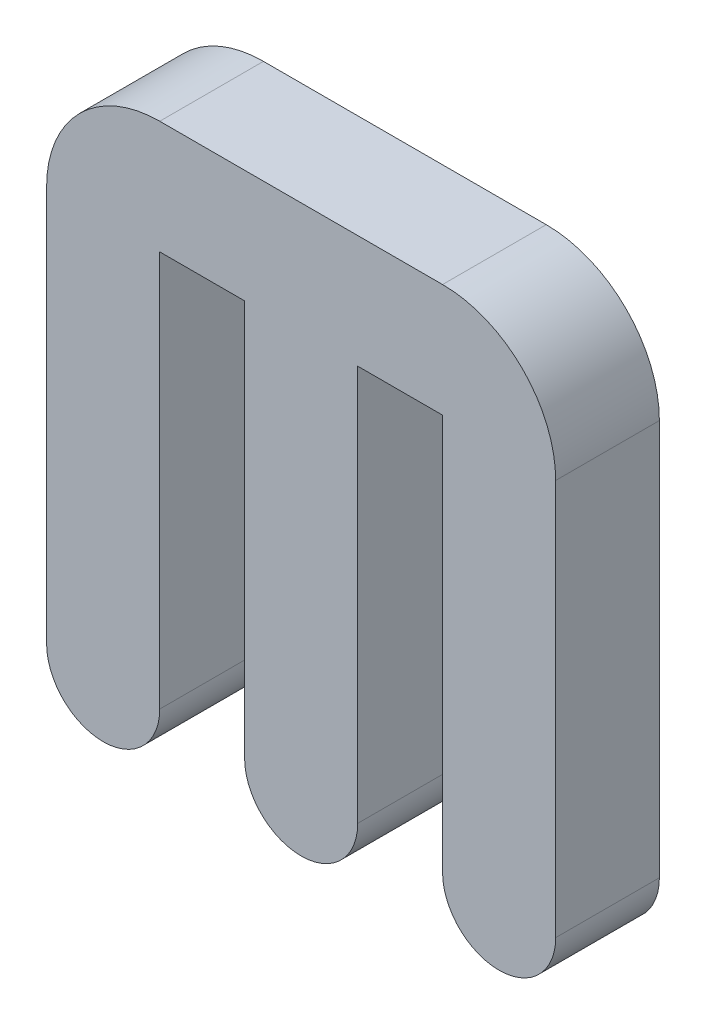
from build123d import *

# Parameters (mm, degrees)
BOSS_EXTRUDE4_DEPTH = 3


with BuildPart() as part:
    # Sketch2 → Boss-Extrude4 (new body)
    with BuildSketch(Plane.XY):
        with BuildLine():
            Line((4.0909095, 8.272726), (-4.0909085, 8.272726))
            ThreePointArc((-4.0909085, 8.272726), (-6.405075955, 7.314166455), (-7.3636355, 4.999999))
            Line((-7.3636355, 4.999999), (-7.3636355, -6.454544))
            ThreePointArc((-7.3636355, -6.454544), (-5.727272, -8.0909075), (-4.0909085, -6.454544))
            Line((-4.0909085, -6.454544), (-4.0909085, 4.999999))
            Line((-4.0909085, 4.999999), (-1.6363635, 4.999999))
            Line((-1.6363635, 4.999999), (-1.6363635, -6.454543))
            ThreePointArc((-1.6363635, -6.454543), (0, -8.0909065), (1.6363635, -6.454543))
            Line((1.6363635, -6.454543), (1.6363635, 4.999999))
            Line((1.6363635, 4.999999), (4.0909095, 4.999999))
            Line((4.0909095, 4.999999), (4.0909095, -6.454547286))
            ThreePointArc((4.0909095, -6.454547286), (5.727273, -8.090910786), (7.3636365, -6.454547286))
            Line((7.3636365, -6.454547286), (7.3636365, 4.999998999))
            ThreePointArc((7.3636365, 4.999998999), (6.405076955, 7.314166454), (4.0909095, 8.272726))
        make_face()
    extrude(amount=BOSS_EXTRUDE4_DEPTH)


solid = part.part
